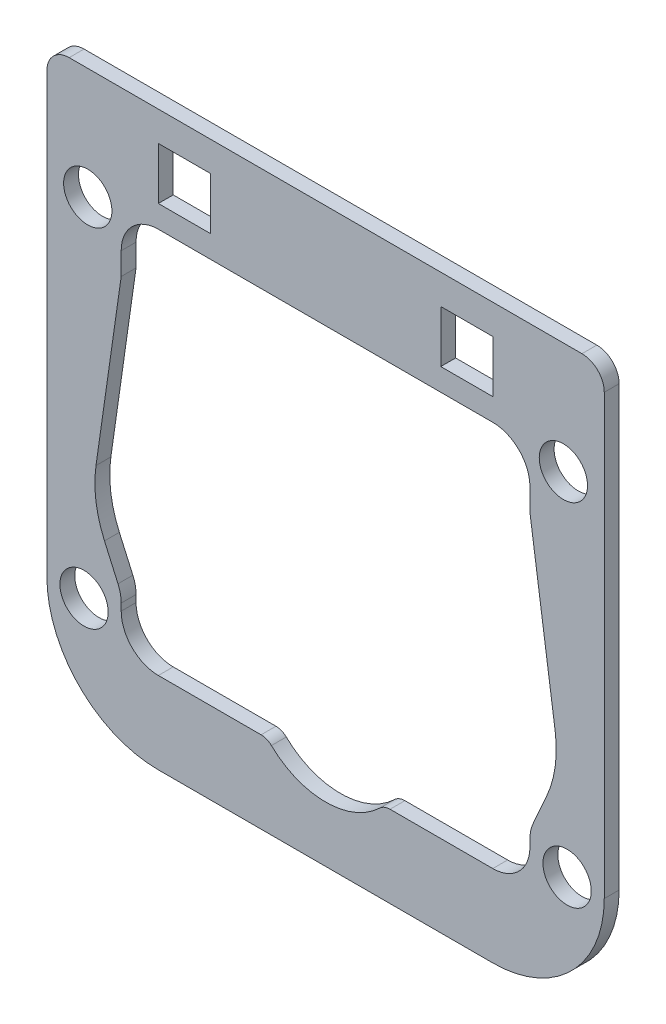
ISO-10303-21;
HEADER;
FILE_DESCRIPTION(('STEP AP214'),'2;1');
FILE_NAME('part.step','',(''),(''),'','','');
FILE_SCHEMA(('AUTOMOTIVE_DESIGN { 1 0 10303 214 1 1 1 1 }'));
ENDSEC;
DATA;
#1=APPLICATION_CONTEXT('core data for automotive mechanical design processes');
#2=APPLICATION_PROTOCOL_DEFINITION('international standard','automotive_design',2000,#1);
#3=PRODUCT_CONTEXT('',#1,'mechanical');
#4=PRODUCT('Part','Part','',(#3));
#5=PRODUCT_RELATED_PRODUCT_CATEGORY('part','',(#4));
#6=PRODUCT_DEFINITION_FORMATION('','',#4);
#7=PRODUCT_DEFINITION_CONTEXT('part definition',#1,'design');
#8=PRODUCT_DEFINITION('design','',#6,#7);
#9=PRODUCT_DEFINITION_SHAPE('','',#8);
#10=(LENGTH_UNIT() NAMED_UNIT(*) SI_UNIT(.MILLI.,.METRE.));
#11=(NAMED_UNIT(*) PLANE_ANGLE_UNIT() SI_UNIT($,.RADIAN.));
#12=(NAMED_UNIT(*) SI_UNIT($,.STERADIAN.) SOLID_ANGLE_UNIT());
#13=UNCERTAINTY_MEASURE_WITH_UNIT(LENGTH_MEASURE(1.E-05),#10,'distance_accuracy_value','');
#14=(GEOMETRIC_REPRESENTATION_CONTEXT(3) GLOBAL_UNCERTAINTY_ASSIGNED_CONTEXT((#13)) GLOBAL_UNIT_ASSIGNED_CONTEXT((#10,
#11,#12)) REPRESENTATION_CONTEXT('',''));
#15=CARTESIAN_POINT('',(0.,0.,0.));
#16=DIRECTION('',(0.,0.,1.));
#17=DIRECTION('',(1.,0.,0.));
#18=AXIS2_PLACEMENT_3D('',#15,#16,#17);
#19=CARTESIAN_POINT('',(15.,-62.,2.));
#20=DIRECTION('',(0.,0.,1.));
#21=DIRECTION('',(1.,0.,0.));
#22=AXIS2_PLACEMENT_3D('',#19,#20,#21);
#23=PLANE('',#22);
#24=DIRECTION('',(-1.,0.,0.));
#25=VECTOR('',#24,1.);
#26=CARTESIAN_POINT('',(22.,-11.,2.));
#27=LINE('',#26,#25);
#28=CARTESIAN_POINT('',(22.,-11.,2.));
#29=VERTEX_POINT('',#28);
#30=CARTESIAN_POINT('',(15.,-11.,2.));
#31=VERTEX_POINT('',#30);
#32=EDGE_CURVE('E323',#29,#31,#27,.T.);
#33=ORIENTED_EDGE('',*,*,#32,.T.);
#34=DIRECTION('',(0.,-1.,0.));
#35=VECTOR('',#34,1.);
#36=CARTESIAN_POINT('',(15.,-4.,2.));
#37=LINE('',#36,#35);
#38=CARTESIAN_POINT('',(15.,-4.,2.));
#39=VERTEX_POINT('',#38);
#40=EDGE_CURVE('E320',#39,#31,#37,.T.);
#41=ORIENTED_EDGE('',*,*,#40,.F.);
#42=DIRECTION('',(1.,0.,0.));
#43=VECTOR('',#42,1.);
#44=CARTESIAN_POINT('',(15.,-4.,2.));
#45=LINE('',#44,#43);
#46=CARTESIAN_POINT('',(22.,-4.,2.));
#47=VERTEX_POINT('',#46);
#48=EDGE_CURVE('E328',#39,#47,#45,.T.);
#49=ORIENTED_EDGE('',*,*,#48,.T.);
#50=DIRECTION('',(0.,1.,0.));
#51=VECTOR('',#50,1.);
#52=CARTESIAN_POINT('',(22.,-11.,2.));
#53=LINE('',#52,#51);
#54=EDGE_CURVE('E326',#29,#47,#53,.T.);
#55=ORIENTED_EDGE('',*,*,#54,.F.);
#56=EDGE_LOOP('',(#33,#41,#49,#55));
#57=FACE_BOUND('',#56,.T.);
#58=CARTESIAN_POINT('',(69.4999999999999,-15.,2.));
#59=DIRECTION('',(0.,0.,-1.));
#60=DIRECTION('',(-1.,0.,0.));
#61=AXIS2_PLACEMENT_3D('',#58,#59,#60);
#62=CIRCLE('',#61,3.25000000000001);
#63=CARTESIAN_POINT('',(66.2499999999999,-15.,2.));
#64=VERTEX_POINT('',#63);
#65=EDGE_CURVE('E343',#64,#64,#62,.T.);
#66=ORIENTED_EDGE('',*,*,#65,.T.);
#67=EDGE_LOOP('',(#66));
#68=FACE_BOUND('',#67,.T.);
#69=CARTESIAN_POINT('',(70.,-62.,2.));
#70=DIRECTION('',(0.,0.,-1.));
#71=DIRECTION('',(-1.,0.,0.));
#72=AXIS2_PLACEMENT_3D('',#69,#70,#71);
#73=CIRCLE('',#72,3.25000000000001);
#74=CARTESIAN_POINT('',(66.75,-62.,2.));
#75=VERTEX_POINT('',#74);
#76=EDGE_CURVE('E349',#75,#75,#73,.T.);
#77=ORIENTED_EDGE('',*,*,#76,.T.);
#78=EDGE_LOOP('',(#77));
#79=FACE_BOUND('',#78,.T.);
#80=CARTESIAN_POINT('',(4.99999999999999,-62.,2.));
#81=DIRECTION('',(0.,0.,1.));
#82=DIRECTION('',(1.,0.,0.));
#83=AXIS2_PLACEMENT_3D('',#80,#81,#82);
#84=CIRCLE('',#83,3.25);
#85=CARTESIAN_POINT('',(8.24999999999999,-62.,2.));
#86=VERTEX_POINT('',#85);
#87=EDGE_CURVE('E361',#86,#86,#84,.T.);
#88=ORIENTED_EDGE('',*,*,#87,.F.);
#89=EDGE_LOOP('',(#88));
#90=FACE_BOUND('',#89,.T.);
#91=DIRECTION('',(1.,0.,0.));
#92=VECTOR('',#91,1.);
#93=CARTESIAN_POINT('',(0.,0.,2.));
#94=LINE('',#93,#92);
#95=CARTESIAN_POINT('',(3.,0.,2.));
#96=VERTEX_POINT('',#95);
#97=CARTESIAN_POINT('',(72.,0.,2.));
#98=VERTEX_POINT('',#97);
#99=EDGE_CURVE('E467',#96,#98,#94,.T.);
#100=ORIENTED_EDGE('',*,*,#99,.F.);
#101=CARTESIAN_POINT('',(3.,-3.,2.));
#102=DIRECTION('',(0.,0.,1.));
#103=DIRECTION('',(1.,0.,0.));
#104=AXIS2_PLACEMENT_3D('',#101,#102,#103);
#105=CIRCLE('',#104,3.);
#106=CARTESIAN_POINT('',(0.,-3.,2.));
#107=VERTEX_POINT('',#106);
#108=EDGE_CURVE('E11',#96,#107,#105,.T.);
#109=ORIENTED_EDGE('',*,*,#108,.T.);
#110=DIRECTION('',(0.,-1.,0.));
#111=VECTOR('',#110,1.);
#112=CARTESIAN_POINT('',(0.,0.,2.));
#113=LINE('',#112,#111);
#114=CARTESIAN_POINT('',(0.,-62.,2.));
#115=VERTEX_POINT('',#114);
#116=EDGE_CURVE('E453',#107,#115,#113,.T.);
#117=ORIENTED_EDGE('',*,*,#116,.T.);
#118=CARTESIAN_POINT('',(15.,-62.,2.));
#119=DIRECTION('',(0.,0.,1.));
#120=DIRECTION('',(1.,0.,0.));
#121=AXIS2_PLACEMENT_3D('',#118,#119,#120);
#122=CIRCLE('',#121,15.);
#123=CARTESIAN_POINT('',(15.,-77.,2.));
#124=VERTEX_POINT('',#123);
#125=EDGE_CURVE('E455',#115,#124,#122,.T.);
#126=ORIENTED_EDGE('',*,*,#125,.T.);
#127=DIRECTION('',(-1.,0.,0.));
#128=VECTOR('',#127,1.);
#129=CARTESIAN_POINT('',(60.,-77.,2.));
#130=LINE('',#129,#128);
#131=CARTESIAN_POINT('',(60.,-77.,2.));
#132=VERTEX_POINT('',#131);
#133=EDGE_CURVE('E458',#132,#124,#130,.T.);
#134=ORIENTED_EDGE('',*,*,#133,.F.);
#135=CARTESIAN_POINT('',(60.,-62.,2.));
#136=DIRECTION('',(0.,0.,1.));
#137=DIRECTION('',(1.,0.,0.));
#138=AXIS2_PLACEMENT_3D('',#135,#136,#137);
#139=CIRCLE('',#138,15.);
#140=CARTESIAN_POINT('',(75.,-62.0000000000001,2.));
#141=VERTEX_POINT('',#140);
#142=EDGE_CURVE('E461',#132,#141,#139,.T.);
#143=ORIENTED_EDGE('',*,*,#142,.T.);
#144=DIRECTION('',(0.,1.,0.));
#145=VECTOR('',#144,1.);
#146=CARTESIAN_POINT('',(75.,-62.0000000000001,2.));
#147=LINE('',#146,#145);
#148=CARTESIAN_POINT('',(75.,-3.,2.));
#149=VERTEX_POINT('',#148);
#150=EDGE_CURVE('E464',#141,#149,#147,.T.);
#151=ORIENTED_EDGE('',*,*,#150,.T.);
#152=CARTESIAN_POINT('',(72.,-3.,2.));
#153=DIRECTION('',(0.,0.,1.));
#154=DIRECTION('',(1.,0.,0.));
#155=AXIS2_PLACEMENT_3D('',#152,#153,#154);
#156=CIRCLE('',#155,3.);
#157=EDGE_CURVE('E577',#149,#98,#156,.T.);
#158=ORIENTED_EDGE('',*,*,#157,.T.);
#159=EDGE_LOOP('',(#100,#109,#117,#126,#134,#143,#151,#158));
#160=FACE_BOUND('',#159,.T.);
#161=DIRECTION('',(-1.,0.,0.));
#162=VECTOR('',#161,1.);
#163=CARTESIAN_POINT('',(65.,-66.,2.));
#164=LINE('',#163,#162);
#165=CARTESIAN_POINT('',(60.,-66.,2.));
#166=VERTEX_POINT('',#165);
#167=CARTESIAN_POINT('',(46.1746757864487,-66.,2.));
#168=VERTEX_POINT('',#167);
#169=EDGE_CURVE('E414',#166,#168,#164,.T.);
#170=ORIENTED_EDGE('',*,*,#169,.T.);
#171=CARTESIAN_POINT('',(46.1746757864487,-68.,2.));
#172=DIRECTION('',(0.,0.,1.));
#173=DIRECTION('',(1.,0.,0.));
#174=AXIS2_PLACEMENT_3D('',#171,#172,#173);
#175=CIRCLE('',#174,2.);
#176=CARTESIAN_POINT('',(44.7867276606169,-66.56,2.));
#177=VERTEX_POINT('',#176);
#178=EDGE_CURVE('E547',#168,#177,#175,.T.);
#179=ORIENTED_EDGE('',*,*,#178,.T.);
#180=CARTESIAN_POINT('',(37.5,-59.,2.));
#181=DIRECTION('',(0.,0.,1.));
#182=DIRECTION('',(1.,0.,0.));
#183=AXIS2_PLACEMENT_3D('',#180,#181,#182);
#184=CIRCLE('',#183,10.5);
#185=CARTESIAN_POINT('',(30.2132723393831,-66.56,2.));
#186=VERTEX_POINT('',#185);
#187=EDGE_CURVE('E411',#186,#177,#184,.T.);
#188=ORIENTED_EDGE('',*,*,#187,.F.);
#189=CARTESIAN_POINT('',(28.8253242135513,-68.,2.));
#190=DIRECTION('',(0.,0.,1.));
#191=DIRECTION('',(1.,0.,0.));
#192=AXIS2_PLACEMENT_3D('',#189,#190,#191);
#193=CIRCLE('',#192,2.);
#194=CARTESIAN_POINT('',(28.8253242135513,-66.,2.));
#195=VERTEX_POINT('',#194);
#196=EDGE_CURVE('E545',#186,#195,#193,.T.);
#197=ORIENTED_EDGE('',*,*,#196,.T.);
#198=DIRECTION('',(-1.,0.,0.));
#199=VECTOR('',#198,1.);
#200=CARTESIAN_POINT('',(29.6737620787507,-66.,2.));
#201=LINE('',#200,#199);
#202=CARTESIAN_POINT('',(15.,-66.,2.));
#203=VERTEX_POINT('',#202);
#204=EDGE_CURVE('E409',#195,#203,#201,.T.);
#205=ORIENTED_EDGE('',*,*,#204,.T.);
#206=CARTESIAN_POINT('',(15.,-61.,2.));
#207=DIRECTION('',(0.,0.,1.));
#208=DIRECTION('',(1.,0.,0.));
#209=AXIS2_PLACEMENT_3D('',#206,#207,#208);
#210=CIRCLE('',#209,5.);
#211=CARTESIAN_POINT('',(9.99999999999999,-61.,2.));
#212=VERTEX_POINT('',#211);
#213=EDGE_CURVE('E505',#203,#212,#210,.F.);
#214=ORIENTED_EDGE('',*,*,#213,.T.);
#215=DIRECTION('',(0.,-1.,0.));
#216=VECTOR('',#215,1.);
#217=CARTESIAN_POINT('',(9.99999999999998,-59.,2.));
#218=LINE('',#217,#216);
#219=CARTESIAN_POINT('',(9.99999999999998,-60.0610722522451,2.));
#220=VERTEX_POINT('',#219);
#221=EDGE_CURVE('E406',#220,#212,#218,.T.);
#222=ORIENTED_EDGE('',*,*,#221,.F.);
#223=CARTESIAN_POINT('',(4.99999999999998,-60.0610722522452,2.));
#224=DIRECTION('',(0.,0.,1.));
#225=DIRECTION('',(1.,0.,0.));
#226=AXIS2_PLACEMENT_3D('',#223,#224,#225);
#227=CIRCLE('',#226,5.);
#228=CARTESIAN_POINT('',(9.56905774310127,-58.0303799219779,2.));
#229=VERTEX_POINT('',#228);
#230=EDGE_CURVE('E494',#220,#229,#227,.T.);
#231=ORIENTED_EDGE('',*,*,#230,.T.);
#232=DIRECTION('',(0.406138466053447,-0.913811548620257,0.));
#233=VECTOR('',#232,1.);
#234=CARTESIAN_POINT('',(5.99999999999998,-50.,2.));
#235=LINE('',#234,#233);
#236=CARTESIAN_POINT('',(7.75220341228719,-53.9424576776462,2.));
#237=VERTEX_POINT('',#236);
#238=EDGE_CURVE('E403',#237,#229,#235,.T.);
#239=ORIENTED_EDGE('',*,*,#238,.F.);
#240=CARTESIAN_POINT('',(21.4593766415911,-47.8503806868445,2.));
#241=DIRECTION('',(0.,0.,1.));
#242=DIRECTION('',(1.,0.,0.));
#243=AXIS2_PLACEMENT_3D('',#240,#241,#242);
#244=CIRCLE('',#243,15.);
#245=CARTESIAN_POINT('',(6.61013423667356,-45.7290603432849,2.));
#246=VERTEX_POINT('',#245);
#247=EDGE_CURVE('E485',#237,#246,#244,.F.);
#248=ORIENTED_EDGE('',*,*,#247,.T.);
#249=DIRECTION('',(-0.141421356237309,-0.989949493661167,0.));
#250=VECTOR('',#249,1.);
#251=CARTESIAN_POINT('',(9.99999999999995,-22.,2.));
#252=LINE('',#251,#250);
#253=CARTESIAN_POINT('',(9.99999999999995,-22.,2.));
#254=VERTEX_POINT('',#253);
#255=EDGE_CURVE('E400',#254,#246,#252,.T.);
#256=ORIENTED_EDGE('',*,*,#255,.F.);
#257=DIRECTION('',(0.,-1.,0.));
#258=VECTOR('',#257,1.);
#259=CARTESIAN_POINT('',(10.,-14.,2.));
#260=LINE('',#259,#258);
#261=CARTESIAN_POINT('',(9.99999999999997,-19.,2.));
#262=VERTEX_POINT('',#261);
#263=EDGE_CURVE('E398',#262,#254,#260,.T.);
#264=ORIENTED_EDGE('',*,*,#263,.F.);
#265=CARTESIAN_POINT('',(15.,-19.,2.));
#266=DIRECTION('',(0.,0.,1.));
#267=DIRECTION('',(1.,0.,0.));
#268=AXIS2_PLACEMENT_3D('',#265,#266,#267);
#269=CIRCLE('',#268,5.);
#270=CARTESIAN_POINT('',(15.,-14.,2.));
#271=VERTEX_POINT('',#270);
#272=EDGE_CURVE('E559',#262,#271,#269,.F.);
#273=ORIENTED_EDGE('',*,*,#272,.T.);
#274=DIRECTION('',(1.,0.,0.));
#275=VECTOR('',#274,1.);
#276=CARTESIAN_POINT('',(10.,-14.,2.));
#277=LINE('',#276,#275);
#278=CARTESIAN_POINT('',(60.,-14.,2.));
#279=VERTEX_POINT('',#278);
#280=EDGE_CURVE('E429',#271,#279,#277,.T.);
#281=ORIENTED_EDGE('',*,*,#280,.T.);
#282=CARTESIAN_POINT('',(60.,-19.,2.));
#283=DIRECTION('',(0.,0.,1.));
#284=DIRECTION('',(1.,0.,0.));
#285=AXIS2_PLACEMENT_3D('',#282,#283,#284);
#286=CIRCLE('',#285,5.);
#287=CARTESIAN_POINT('',(65.,-19.,2.));
#288=VERTEX_POINT('',#287);
#289=EDGE_CURVE('E568',#279,#288,#286,.F.);
#290=ORIENTED_EDGE('',*,*,#289,.T.);
#291=DIRECTION('',(0.,1.,0.));
#292=VECTOR('',#291,1.);
#293=CARTESIAN_POINT('',(65.,-22.,2.));
#294=LINE('',#293,#292);
#295=CARTESIAN_POINT('',(65.,-22.,2.));
#296=VERTEX_POINT('',#295);
#297=EDGE_CURVE('E426',#296,#288,#294,.T.);
#298=ORIENTED_EDGE('',*,*,#297,.F.);
#299=DIRECTION('',(0.141421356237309,-0.989949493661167,0.));
#300=VECTOR('',#299,1.);
#301=CARTESIAN_POINT('',(65.,-22.,2.));
#302=LINE('',#301,#300);
#303=CARTESIAN_POINT('',(68.3898657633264,-45.7290603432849,2.));
#304=VERTEX_POINT('',#303);
#305=EDGE_CURVE('E423',#296,#304,#302,.T.);
#306=ORIENTED_EDGE('',*,*,#305,.T.);
#307=CARTESIAN_POINT('',(53.5406233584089,-47.8503806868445,2.));
#308=DIRECTION('',(0.,0.,1.));
#309=DIRECTION('',(1.,0.,0.));
#310=AXIS2_PLACEMENT_3D('',#307,#308,#309);
#311=CIRCLE('',#310,15.);
#312=CARTESIAN_POINT('',(67.2477965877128,-53.9424576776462,2.));
#313=VERTEX_POINT('',#312);
#314=EDGE_CURVE('E514',#304,#313,#311,.F.);
#315=ORIENTED_EDGE('',*,*,#314,.T.);
#316=DIRECTION('',(-0.406138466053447,-0.913811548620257,0.));
#317=VECTOR('',#316,1.);
#318=CARTESIAN_POINT('',(69.,-50.,2.));
#319=LINE('',#318,#317);
#320=CARTESIAN_POINT('',(65.4309422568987,-58.0303799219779,2.));
#321=VERTEX_POINT('',#320);
#322=EDGE_CURVE('E420',#313,#321,#319,.T.);
#323=ORIENTED_EDGE('',*,*,#322,.T.);
#324=CARTESIAN_POINT('',(70.,-60.0610722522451,2.));
#325=DIRECTION('',(0.,0.,1.));
#326=DIRECTION('',(1.,0.,0.));
#327=AXIS2_PLACEMENT_3D('',#324,#325,#326);
#328=CIRCLE('',#327,5.);
#329=CARTESIAN_POINT('',(65.,-60.0610722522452,2.));
#330=VERTEX_POINT('',#329);
#331=EDGE_CURVE('E525',#321,#330,#328,.T.);
#332=ORIENTED_EDGE('',*,*,#331,.T.);
#333=DIRECTION('',(0.,1.,0.));
#334=VECTOR('',#333,1.);
#335=CARTESIAN_POINT('',(65.,-66.,2.));
#336=LINE('',#335,#334);
#337=CARTESIAN_POINT('',(65.,-61.,2.));
#338=VERTEX_POINT('',#337);
#339=EDGE_CURVE('E417',#338,#330,#336,.T.);
#340=ORIENTED_EDGE('',*,*,#339,.F.);
#341=CARTESIAN_POINT('',(60.,-61.,2.));
#342=DIRECTION('',(0.,0.,1.));
#343=DIRECTION('',(1.,0.,0.));
#344=AXIS2_PLACEMENT_3D('',#341,#342,#343);
#345=CIRCLE('',#344,5.);
#346=EDGE_CURVE('E532',#338,#166,#345,.F.);
#347=ORIENTED_EDGE('',*,*,#346,.T.);
#348=EDGE_LOOP('',(#170,#179,#188,#197,#205,#214,#222,#231,#239,#248,#256,#264,#273,#281,#290,
#298,#306,#315,#323,#332,#340,#347));
#349=FACE_BOUND('',#348,.T.);
#350=CARTESIAN_POINT('',(5.5,-15.,2.));
#351=DIRECTION('',(0.,0.,1.));
#352=DIRECTION('',(1.,0.,0.));
#353=AXIS2_PLACEMENT_3D('',#350,#351,#352);
#354=CIRCLE('',#353,3.25);
#355=CARTESIAN_POINT('',(8.75,-15.,2.));
#356=VERTEX_POINT('',#355);
#357=EDGE_CURVE('E355',#356,#356,#354,.T.);
#358=ORIENTED_EDGE('',*,*,#357,.F.);
#359=EDGE_LOOP('',(#358));
#360=FACE_BOUND('',#359,.T.);
#361=DIRECTION('',(0.,-1.,0.));
#362=VECTOR('',#361,1.);
#363=CARTESIAN_POINT('',(60.,-4.,2.));
#364=LINE('',#363,#362);
#365=CARTESIAN_POINT('',(60.,-4.,2.));
#366=VERTEX_POINT('',#365);
#367=CARTESIAN_POINT('',(60.,-11.,2.));
#368=VERTEX_POINT('',#367);
#369=EDGE_CURVE('E297',#366,#368,#364,.T.);
#370=ORIENTED_EDGE('',*,*,#369,.T.);
#371=DIRECTION('',(1.,0.,0.));
#372=VECTOR('',#371,1.);
#373=CARTESIAN_POINT('',(53.,-11.,2.));
#374=LINE('',#373,#372);
#375=CARTESIAN_POINT('',(53.,-11.,2.));
#376=VERTEX_POINT('',#375);
#377=EDGE_CURVE('E273',#376,#368,#374,.T.);
#378=ORIENTED_EDGE('',*,*,#377,.F.);
#379=DIRECTION('',(0.,1.,0.));
#380=VECTOR('',#379,1.);
#381=CARTESIAN_POINT('',(53.,-11.,2.));
#382=LINE('',#381,#380);
#383=CARTESIAN_POINT('',(53.,-4.,2.));
#384=VERTEX_POINT('',#383);
#385=EDGE_CURVE('E301',#376,#384,#382,.T.);
#386=ORIENTED_EDGE('',*,*,#385,.T.);
#387=DIRECTION('',(-1.,0.,0.));
#388=VECTOR('',#387,1.);
#389=CARTESIAN_POINT('',(60.,-4.,2.));
#390=LINE('',#389,#388);
#391=EDGE_CURVE('E299',#366,#384,#390,.T.);
#392=ORIENTED_EDGE('',*,*,#391,.F.);
#393=EDGE_LOOP('',(#370,#378,#386,#392));
#394=FACE_BOUND('',#393,.T.);
#395=ADVANCED_FACE('F24',(#57,#68,#79,#90,#160,#349,#360,#394),#23,.T.);
#396=CARTESIAN_POINT('',(15.,-62.,0.));
#397=DIRECTION('',(0.,0.,1.));
#398=DIRECTION('',(1.,0.,0.));
#399=AXIS2_PLACEMENT_3D('',#396,#397,#398);
#400=PLANE('',#399);
#401=DIRECTION('',(0.,-1.,0.));
#402=VECTOR('',#401,1.);
#403=CARTESIAN_POINT('',(15.,-4.,0.));
#404=LINE('',#403,#402);
#405=CARTESIAN_POINT('',(15.,-4.,0.));
#406=VERTEX_POINT('',#405);
#407=CARTESIAN_POINT('',(15.,-11.,0.));
#408=VERTEX_POINT('',#407);
#409=EDGE_CURVE('E277',#406,#408,#404,.T.);
#410=ORIENTED_EDGE('',*,*,#409,.T.);
#411=DIRECTION('',(-1.,0.,0.));
#412=VECTOR('',#411,1.);
#413=CARTESIAN_POINT('',(22.,-11.,0.));
#414=LINE('',#413,#412);
#415=CARTESIAN_POINT('',(22.,-11.,0.));
#416=VERTEX_POINT('',#415);
#417=EDGE_CURVE('E311',#416,#408,#414,.T.);
#418=ORIENTED_EDGE('',*,*,#417,.F.);
#419=DIRECTION('',(0.,1.,0.));
#420=VECTOR('',#419,1.);
#421=CARTESIAN_POINT('',(22.,-11.,0.));
#422=LINE('',#421,#420);
#423=CARTESIAN_POINT('',(22.,-4.,0.));
#424=VERTEX_POINT('',#423);
#425=EDGE_CURVE('E314',#416,#424,#422,.T.);
#426=ORIENTED_EDGE('',*,*,#425,.T.);
#427=DIRECTION('',(1.,0.,0.));
#428=VECTOR('',#427,1.);
#429=CARTESIAN_POINT('',(15.,-4.,0.));
#430=LINE('',#429,#428);
#431=EDGE_CURVE('E317',#406,#424,#430,.T.);
#432=ORIENTED_EDGE('',*,*,#431,.F.);
#433=EDGE_LOOP('',(#410,#418,#426,#432));
#434=FACE_BOUND('',#433,.T.);
#435=CARTESIAN_POINT('',(69.4999999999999,-15.,0.));
#436=DIRECTION('',(0.,0.,-1.));
#437=DIRECTION('',(-1.,0.,0.));
#438=AXIS2_PLACEMENT_3D('',#435,#436,#437);
#439=CIRCLE('',#438,3.25000000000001);
#440=CARTESIAN_POINT('',(66.2499999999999,-15.,0.));
#441=VERTEX_POINT('',#440);
#442=EDGE_CURVE('E340',#441,#441,#439,.T.);
#443=ORIENTED_EDGE('',*,*,#442,.F.);
#444=EDGE_LOOP('',(#443));
#445=FACE_BOUND('',#444,.T.);
#446=CARTESIAN_POINT('',(70.,-62.,0.));
#447=DIRECTION('',(0.,0.,-1.));
#448=DIRECTION('',(-1.,0.,0.));
#449=AXIS2_PLACEMENT_3D('',#446,#447,#448);
#450=CIRCLE('',#449,3.25000000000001);
#451=CARTESIAN_POINT('',(66.75,-62.,0.));
#452=VERTEX_POINT('',#451);
#453=EDGE_CURVE('E346',#452,#452,#450,.T.);
#454=ORIENTED_EDGE('',*,*,#453,.F.);
#455=EDGE_LOOP('',(#454));
#456=FACE_BOUND('',#455,.T.);
#457=CARTESIAN_POINT('',(4.99999999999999,-62.,0.));
#458=DIRECTION('',(0.,0.,1.));
#459=DIRECTION('',(1.,0.,0.));
#460=AXIS2_PLACEMENT_3D('',#457,#458,#459);
#461=CIRCLE('',#460,3.25);
#462=CARTESIAN_POINT('',(8.24999999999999,-62.,0.));
#463=VERTEX_POINT('',#462);
#464=EDGE_CURVE('E358',#463,#463,#461,.T.);
#465=ORIENTED_EDGE('',*,*,#464,.T.);
#466=EDGE_LOOP('',(#465));
#467=FACE_BOUND('',#466,.T.);
#468=DIRECTION('',(0.,-1.,0.));
#469=VECTOR('',#468,1.);
#470=CARTESIAN_POINT('',(0.,0.,0.));
#471=LINE('',#470,#469);
#472=CARTESIAN_POINT('',(0.,-3.,0.));
#473=VERTEX_POINT('',#472);
#474=CARTESIAN_POINT('',(0.,-62.,0.));
#475=VERTEX_POINT('',#474);
#476=EDGE_CURVE('E437',#473,#475,#471,.T.);
#477=ORIENTED_EDGE('',*,*,#476,.F.);
#478=CARTESIAN_POINT('',(3.,-3.,0.));
#479=DIRECTION('',(0.,0.,1.));
#480=DIRECTION('',(1.,0.,0.));
#481=AXIS2_PLACEMENT_3D('',#478,#479,#480);
#482=CIRCLE('',#481,3.);
#483=CARTESIAN_POINT('',(3.,0.,0.));
#484=VERTEX_POINT('',#483);
#485=EDGE_CURVE('E46',#473,#484,#482,.F.);
#486=ORIENTED_EDGE('',*,*,#485,.T.);
#487=DIRECTION('',(1.,0.,0.));
#488=VECTOR('',#487,1.);
#489=CARTESIAN_POINT('',(0.,0.,0.));
#490=LINE('',#489,#488);
#491=CARTESIAN_POINT('',(72.,0.,0.));
#492=VERTEX_POINT('',#491);
#493=EDGE_CURVE('E451',#484,#492,#490,.T.);
#494=ORIENTED_EDGE('',*,*,#493,.T.);
#495=CARTESIAN_POINT('',(72.,-3.,0.));
#496=DIRECTION('',(0.,0.,1.));
#497=DIRECTION('',(1.,0.,0.));
#498=AXIS2_PLACEMENT_3D('',#495,#496,#497);
#499=CIRCLE('',#498,3.);
#500=CARTESIAN_POINT('',(75.,-3.,0.));
#501=VERTEX_POINT('',#500);
#502=EDGE_CURVE('E573',#492,#501,#499,.F.);
#503=ORIENTED_EDGE('',*,*,#502,.T.);
#504=DIRECTION('',(0.,1.,0.));
#505=VECTOR('',#504,1.);
#506=CARTESIAN_POINT('',(75.,-62.0000000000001,0.));
#507=LINE('',#506,#505);
#508=CARTESIAN_POINT('',(75.,-62.0000000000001,0.));
#509=VERTEX_POINT('',#508);
#510=EDGE_CURVE('E448',#509,#501,#507,.T.);
#511=ORIENTED_EDGE('',*,*,#510,.F.);
#512=CARTESIAN_POINT('',(60.,-62.,0.));
#513=DIRECTION('',(0.,0.,1.));
#514=DIRECTION('',(1.,0.,0.));
#515=AXIS2_PLACEMENT_3D('',#512,#513,#514);
#516=CIRCLE('',#515,15.);
#517=CARTESIAN_POINT('',(60.,-77.,0.));
#518=VERTEX_POINT('',#517);
#519=EDGE_CURVE('E445',#518,#509,#516,.T.);
#520=ORIENTED_EDGE('',*,*,#519,.F.);
#521=DIRECTION('',(-1.,0.,0.));
#522=VECTOR('',#521,1.);
#523=CARTESIAN_POINT('',(60.,-77.,0.));
#524=LINE('',#523,#522);
#525=CARTESIAN_POINT('',(15.,-77.,0.));
#526=VERTEX_POINT('',#525);
#527=EDGE_CURVE('E442',#518,#526,#524,.T.);
#528=ORIENTED_EDGE('',*,*,#527,.T.);
#529=CARTESIAN_POINT('',(15.,-62.,0.));
#530=DIRECTION('',(0.,0.,1.));
#531=DIRECTION('',(1.,0.,0.));
#532=AXIS2_PLACEMENT_3D('',#529,#530,#531);
#533=CIRCLE('',#532,15.);
#534=EDGE_CURVE('E439',#475,#526,#533,.T.);
#535=ORIENTED_EDGE('',*,*,#534,.F.);
#536=EDGE_LOOP('',(#477,#486,#494,#503,#511,#520,#528,#535));
#537=FACE_BOUND('',#536,.T.);
#538=CARTESIAN_POINT('',(37.5,-59.,0.));
#539=DIRECTION('',(0.,0.,1.));
#540=DIRECTION('',(1.,0.,0.));
#541=AXIS2_PLACEMENT_3D('',#538,#539,#540);
#542=CIRCLE('',#541,10.5);
#543=CARTESIAN_POINT('',(30.2132723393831,-66.56,0.));
#544=VERTEX_POINT('',#543);
#545=CARTESIAN_POINT('',(44.7867276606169,-66.56,0.));
#546=VERTEX_POINT('',#545);
#547=EDGE_CURVE('E377',#544,#546,#542,.T.);
#548=ORIENTED_EDGE('',*,*,#547,.T.);
#549=CARTESIAN_POINT('',(46.1746757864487,-68.,0.));
#550=DIRECTION('',(0.,0.,1.));
#551=DIRECTION('',(1.,0.,0.));
#552=AXIS2_PLACEMENT_3D('',#549,#550,#551);
#553=CIRCLE('',#552,2.);
#554=CARTESIAN_POINT('',(46.1746757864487,-66.,0.));
#555=VERTEX_POINT('',#554);
#556=EDGE_CURVE('E541',#546,#555,#553,.F.);
#557=ORIENTED_EDGE('',*,*,#556,.T.);
#558=DIRECTION('',(-1.,0.,0.));
#559=VECTOR('',#558,1.);
#560=CARTESIAN_POINT('',(65.,-66.,0.));
#561=LINE('',#560,#559);
#562=CARTESIAN_POINT('',(60.,-66.,0.));
#563=VERTEX_POINT('',#562);
#564=EDGE_CURVE('E380',#563,#555,#561,.T.);
#565=ORIENTED_EDGE('',*,*,#564,.F.);
#566=CARTESIAN_POINT('',(60.,-61.,0.));
#567=DIRECTION('',(0.,0.,1.));
#568=DIRECTION('',(1.,0.,0.));
#569=AXIS2_PLACEMENT_3D('',#566,#567,#568);
#570=CIRCLE('',#569,5.);
#571=CARTESIAN_POINT('',(65.,-61.,0.));
#572=VERTEX_POINT('',#571);
#573=EDGE_CURVE('E530',#563,#572,#570,.T.);
#574=ORIENTED_EDGE('',*,*,#573,.T.);
#575=DIRECTION('',(0.,1.,0.));
#576=VECTOR('',#575,1.);
#577=CARTESIAN_POINT('',(65.,-66.,0.));
#578=LINE('',#577,#576);
#579=CARTESIAN_POINT('',(65.,-60.0610722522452,0.));
#580=VERTEX_POINT('',#579);
#581=EDGE_CURVE('E383',#572,#580,#578,.T.);
#582=ORIENTED_EDGE('',*,*,#581,.T.);
#583=CARTESIAN_POINT('',(70.,-60.0610722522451,0.));
#584=DIRECTION('',(0.,0.,1.));
#585=DIRECTION('',(1.,0.,0.));
#586=AXIS2_PLACEMENT_3D('',#583,#584,#585);
#587=CIRCLE('',#586,5.);
#588=CARTESIAN_POINT('',(65.4309422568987,-58.0303799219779,0.));
#589=VERTEX_POINT('',#588);
#590=EDGE_CURVE('E521',#580,#589,#587,.F.);
#591=ORIENTED_EDGE('',*,*,#590,.T.);
#592=DIRECTION('',(-0.406138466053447,-0.913811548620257,0.));
#593=VECTOR('',#592,1.);
#594=CARTESIAN_POINT('',(69.,-50.,0.));
#595=LINE('',#594,#593);
#596=CARTESIAN_POINT('',(67.2477965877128,-53.9424576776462,0.));
#597=VERTEX_POINT('',#596);
#598=EDGE_CURVE('E386',#597,#589,#595,.T.);
#599=ORIENTED_EDGE('',*,*,#598,.F.);
#600=CARTESIAN_POINT('',(53.5406233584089,-47.8503806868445,0.));
#601=DIRECTION('',(0.,0.,1.));
#602=DIRECTION('',(1.,0.,0.));
#603=AXIS2_PLACEMENT_3D('',#600,#601,#602);
#604=CIRCLE('',#603,15.);
#605=CARTESIAN_POINT('',(68.3898657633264,-45.7290603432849,0.));
#606=VERTEX_POINT('',#605);
#607=EDGE_CURVE('E512',#597,#606,#604,.T.);
#608=ORIENTED_EDGE('',*,*,#607,.T.);
#609=DIRECTION('',(0.141421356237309,-0.989949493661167,0.));
#610=VECTOR('',#609,1.);
#611=CARTESIAN_POINT('',(65.,-22.,0.));
#612=LINE('',#611,#610);
#613=CARTESIAN_POINT('',(65.,-22.,0.));
#614=VERTEX_POINT('',#613);
#615=EDGE_CURVE('E389',#614,#606,#612,.T.);
#616=ORIENTED_EDGE('',*,*,#615,.F.);
#617=DIRECTION('',(0.,1.,0.));
#618=VECTOR('',#617,1.);
#619=CARTESIAN_POINT('',(65.,-22.,0.));
#620=LINE('',#619,#618);
#621=CARTESIAN_POINT('',(65.,-19.,0.));
#622=VERTEX_POINT('',#621);
#623=EDGE_CURVE('E392',#614,#622,#620,.T.);
#624=ORIENTED_EDGE('',*,*,#623,.T.);
#625=CARTESIAN_POINT('',(60.,-19.,0.));
#626=DIRECTION('',(0.,0.,1.));
#627=DIRECTION('',(1.,0.,0.));
#628=AXIS2_PLACEMENT_3D('',#625,#626,#627);
#629=CIRCLE('',#628,5.);
#630=CARTESIAN_POINT('',(60.,-14.,0.));
#631=VERTEX_POINT('',#630);
#632=EDGE_CURVE('E566',#622,#631,#629,.T.);
#633=ORIENTED_EDGE('',*,*,#632,.T.);
#634=DIRECTION('',(1.,0.,0.));
#635=VECTOR('',#634,1.);
#636=CARTESIAN_POINT('',(10.,-14.,0.));
#637=LINE('',#636,#635);
#638=CARTESIAN_POINT('',(15.,-14.,0.));
#639=VERTEX_POINT('',#638);
#640=EDGE_CURVE('E395',#639,#631,#637,.T.);
#641=ORIENTED_EDGE('',*,*,#640,.F.);
#642=CARTESIAN_POINT('',(15.,-19.,0.));
#643=DIRECTION('',(0.,0.,1.));
#644=DIRECTION('',(1.,0.,0.));
#645=AXIS2_PLACEMENT_3D('',#642,#643,#644);
#646=CIRCLE('',#645,5.);
#647=CARTESIAN_POINT('',(9.99999999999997,-19.,0.));
#648=VERTEX_POINT('',#647);
#649=EDGE_CURVE('E557',#639,#648,#646,.T.);
#650=ORIENTED_EDGE('',*,*,#649,.T.);
#651=DIRECTION('',(0.,-1.,0.));
#652=VECTOR('',#651,1.);
#653=CARTESIAN_POINT('',(10.,-14.,0.));
#654=LINE('',#653,#652);
#655=CARTESIAN_POINT('',(9.99999999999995,-22.,0.));
#656=VERTEX_POINT('',#655);
#657=EDGE_CURVE('E364',#648,#656,#654,.T.);
#658=ORIENTED_EDGE('',*,*,#657,.T.);
#659=DIRECTION('',(-0.141421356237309,-0.989949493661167,0.));
#660=VECTOR('',#659,1.);
#661=CARTESIAN_POINT('',(9.99999999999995,-22.,0.));
#662=LINE('',#661,#660);
#663=CARTESIAN_POINT('',(6.61013423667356,-45.7290603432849,0.));
#664=VERTEX_POINT('',#663);
#665=EDGE_CURVE('E366',#656,#664,#662,.T.);
#666=ORIENTED_EDGE('',*,*,#665,.T.);
#667=CARTESIAN_POINT('',(21.4593766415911,-47.8503806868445,0.));
#668=DIRECTION('',(0.,0.,1.));
#669=DIRECTION('',(1.,0.,0.));
#670=AXIS2_PLACEMENT_3D('',#667,#668,#669);
#671=CIRCLE('',#670,15.);
#672=CARTESIAN_POINT('',(7.75220341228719,-53.9424576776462,0.));
#673=VERTEX_POINT('',#672);
#674=EDGE_CURVE('E483',#664,#673,#671,.T.);
#675=ORIENTED_EDGE('',*,*,#674,.T.);
#676=DIRECTION('',(0.406138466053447,-0.913811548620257,0.));
#677=VECTOR('',#676,1.);
#678=CARTESIAN_POINT('',(5.99999999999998,-50.,0.));
#679=LINE('',#678,#677);
#680=CARTESIAN_POINT('',(9.56905774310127,-58.0303799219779,0.));
#681=VERTEX_POINT('',#680);
#682=EDGE_CURVE('E369',#673,#681,#679,.T.);
#683=ORIENTED_EDGE('',*,*,#682,.T.);
#684=CARTESIAN_POINT('',(4.99999999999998,-60.0610722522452,0.));
#685=DIRECTION('',(0.,0.,1.));
#686=DIRECTION('',(1.,0.,0.));
#687=AXIS2_PLACEMENT_3D('',#684,#685,#686);
#688=CIRCLE('',#687,5.);
#689=CARTESIAN_POINT('',(9.99999999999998,-60.0610722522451,0.));
#690=VERTEX_POINT('',#689);
#691=EDGE_CURVE('E490',#681,#690,#688,.F.);
#692=ORIENTED_EDGE('',*,*,#691,.T.);
#693=DIRECTION('',(0.,-1.,0.));
#694=VECTOR('',#693,1.);
#695=CARTESIAN_POINT('',(9.99999999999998,-59.,0.));
#696=LINE('',#695,#694);
#697=CARTESIAN_POINT('',(9.99999999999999,-61.,0.));
#698=VERTEX_POINT('',#697);
#699=EDGE_CURVE('E372',#690,#698,#696,.T.);
#700=ORIENTED_EDGE('',*,*,#699,.T.);
#701=CARTESIAN_POINT('',(15.,-61.,0.));
#702=DIRECTION('',(0.,0.,1.));
#703=DIRECTION('',(1.,0.,0.));
#704=AXIS2_PLACEMENT_3D('',#701,#702,#703);
#705=CIRCLE('',#704,5.);
#706=CARTESIAN_POINT('',(15.,-66.,0.));
#707=VERTEX_POINT('',#706);
#708=EDGE_CURVE('E502',#698,#707,#705,.T.);
#709=ORIENTED_EDGE('',*,*,#708,.T.);
#710=DIRECTION('',(-1.,0.,0.));
#711=VECTOR('',#710,1.);
#712=CARTESIAN_POINT('',(29.6737620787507,-66.,0.));
#713=LINE('',#712,#711);
#714=CARTESIAN_POINT('',(28.8253242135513,-66.,0.));
#715=VERTEX_POINT('',#714);
#716=EDGE_CURVE('E375',#715,#707,#713,.T.);
#717=ORIENTED_EDGE('',*,*,#716,.F.);
#718=CARTESIAN_POINT('',(28.8253242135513,-68.,0.));
#719=DIRECTION('',(0.,0.,1.));
#720=DIRECTION('',(1.,0.,0.));
#721=AXIS2_PLACEMENT_3D('',#718,#719,#720);
#722=CIRCLE('',#721,2.);
#723=EDGE_CURVE('E539',#715,#544,#722,.F.);
#724=ORIENTED_EDGE('',*,*,#723,.T.);
#725=EDGE_LOOP('',(#548,#557,#565,#574,#582,#591,#599,#608,#616,#624,#633,#641,#650,#658,#666,
#675,#683,#692,#700,#709,#717,#724));
#726=FACE_BOUND('',#725,.T.);
#727=CARTESIAN_POINT('',(5.5,-15.,0.));
#728=DIRECTION('',(0.,0.,1.));
#729=DIRECTION('',(1.,0.,0.));
#730=AXIS2_PLACEMENT_3D('',#727,#728,#729);
#731=CIRCLE('',#730,3.25);
#732=CARTESIAN_POINT('',(8.75,-15.,0.));
#733=VERTEX_POINT('',#732);
#734=EDGE_CURVE('E352',#733,#733,#731,.T.);
#735=ORIENTED_EDGE('',*,*,#734,.T.);
#736=EDGE_LOOP('',(#735));
#737=FACE_BOUND('',#736,.T.);
#738=DIRECTION('',(1.,0.,0.));
#739=VECTOR('',#738,1.);
#740=CARTESIAN_POINT('',(53.,-11.,0.));
#741=LINE('',#740,#739);
#742=CARTESIAN_POINT('',(53.,-11.,0.));
#743=VERTEX_POINT('',#742);
#744=CARTESIAN_POINT('',(60.,-11.,0.));
#745=VERTEX_POINT('',#744);
#746=EDGE_CURVE('E270',#743,#745,#741,.T.);
#747=ORIENTED_EDGE('',*,*,#746,.T.);
#748=DIRECTION('',(0.,-1.,0.));
#749=VECTOR('',#748,1.);
#750=CARTESIAN_POINT('',(60.,-4.,0.));
#751=LINE('',#750,#749);
#752=CARTESIAN_POINT('',(60.,-4.,0.));
#753=VERTEX_POINT('',#752);
#754=EDGE_CURVE('E281',#753,#745,#751,.T.);
#755=ORIENTED_EDGE('',*,*,#754,.F.);
#756=DIRECTION('',(-1.,0.,0.));
#757=VECTOR('',#756,1.);
#758=CARTESIAN_POINT('',(60.,-4.,0.));
#759=LINE('',#758,#757);
#760=CARTESIAN_POINT('',(53.,-4.,0.));
#761=VERTEX_POINT('',#760);
#762=EDGE_CURVE('E286',#753,#761,#759,.T.);
#763=ORIENTED_EDGE('',*,*,#762,.T.);
#764=DIRECTION('',(0.,1.,0.));
#765=VECTOR('',#764,1.);
#766=CARTESIAN_POINT('',(53.,-11.,0.));
#767=LINE('',#766,#765);
#768=EDGE_CURVE('E291',#743,#761,#767,.T.);
#769=ORIENTED_EDGE('',*,*,#768,.F.);
#770=EDGE_LOOP('',(#747,#755,#763,#769));
#771=FACE_BOUND('',#770,.T.);
#772=ADVANCED_FACE('F289',(#434,#445,#456,#467,#537,#726,#737,#771),#400,.F.);
#773=CARTESIAN_POINT('',(0.,0.,2.));
#774=DIRECTION('',(1.,0.,0.));
#775=DIRECTION('',(0.,1.,0.));
#776=AXIS2_PLACEMENT_3D('',#773,#774,#775);
#777=PLANE('',#776);
#778=ORIENTED_EDGE('',*,*,#116,.F.);
#779=DIRECTION('',(0.,0.,-1.));
#780=VECTOR('',#779,1.);
#781=CARTESIAN_POINT('',(0.,-3.,2.));
#782=LINE('',#781,#780);
#783=EDGE_CURVE('E580',#107,#473,#782,.T.);
#784=ORIENTED_EDGE('',*,*,#783,.T.);
#785=ORIENTED_EDGE('',*,*,#476,.T.);
#786=DIRECTION('',(0.,0.,-1.));
#787=VECTOR('',#786,1.);
#788=CARTESIAN_POINT('',(0.,-62.,2.));
#789=LINE('',#788,#787);
#790=EDGE_CURVE('E475',#115,#475,#789,.T.);
#791=ORIENTED_EDGE('',*,*,#790,.F.);
#792=EDGE_LOOP('',(#778,#784,#785,#791));
#793=FACE_BOUND('',#792,.T.);
#794=ADVANCED_FACE('F586',(#793),#777,.F.);
#795=CARTESIAN_POINT('',(15.,-62.,2.));
#796=DIRECTION('',(0.,0.,-1.));
#797=DIRECTION('',(-1.,0.,0.));
#798=AXIS2_PLACEMENT_3D('',#795,#796,#797);
#799=CYLINDRICAL_SURFACE('',#798,15.);
#800=DIRECTION('',(0.,0.,-1.));
#801=VECTOR('',#800,1.);
#802=CARTESIAN_POINT('',(15.,-77.,2.));
#803=LINE('',#802,#801);
#804=EDGE_CURVE('E473',#124,#526,#803,.T.);
#805=ORIENTED_EDGE('',*,*,#804,.F.);
#806=ORIENTED_EDGE('',*,*,#125,.F.);
#807=ORIENTED_EDGE('',*,*,#790,.T.);
#808=ORIENTED_EDGE('',*,*,#534,.T.);
#809=EDGE_LOOP('',(#805,#806,#807,#808));
#810=FACE_BOUND('',#809,.T.);
#811=ADVANCED_FACE('F26',(#810),#799,.T.);
#812=CARTESIAN_POINT('',(60.,-77.,2.));
#813=DIRECTION('',(0.,-1.,0.));
#814=DIRECTION('',(1.,0.,0.));
#815=AXIS2_PLACEMENT_3D('',#812,#813,#814);
#816=PLANE('',#815);
#817=DIRECTION('',(0.,0.,-1.));
#818=VECTOR('',#817,1.);
#819=CARTESIAN_POINT('',(60.,-77.,2.));
#820=LINE('',#819,#818);
#821=EDGE_CURVE('E471',#132,#518,#820,.T.);
#822=ORIENTED_EDGE('',*,*,#821,.F.);
#823=ORIENTED_EDGE('',*,*,#133,.T.);
#824=ORIENTED_EDGE('',*,*,#804,.T.);
#825=ORIENTED_EDGE('',*,*,#527,.F.);
#826=EDGE_LOOP('',(#822,#823,#824,#825));
#827=FACE_BOUND('',#826,.T.);
#828=ADVANCED_FACE('F601',(#827),#816,.T.);
#829=CARTESIAN_POINT('',(60.,-62.,2.));
#830=DIRECTION('',(0.,0.,-1.));
#831=DIRECTION('',(-1.,0.,0.));
#832=AXIS2_PLACEMENT_3D('',#829,#830,#831);
#833=CYLINDRICAL_SURFACE('',#832,15.);
#834=DIRECTION('',(0.,0.,-1.));
#835=VECTOR('',#834,1.);
#836=CARTESIAN_POINT('',(75.,-62.0000000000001,2.));
#837=LINE('',#836,#835);
#838=EDGE_CURVE('E469',#141,#509,#837,.T.);
#839=ORIENTED_EDGE('',*,*,#838,.F.);
#840=ORIENTED_EDGE('',*,*,#142,.F.);
#841=ORIENTED_EDGE('',*,*,#821,.T.);
#842=ORIENTED_EDGE('',*,*,#519,.T.);
#843=EDGE_LOOP('',(#839,#840,#841,#842));
#844=FACE_BOUND('',#843,.T.);
#845=ADVANCED_FACE('F603',(#844),#833,.T.);
#846=CARTESIAN_POINT('',(75.,-62.0000000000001,2.));
#847=DIRECTION('',(-1.,0.,0.));
#848=DIRECTION('',(0.,0.,1.));
#849=AXIS2_PLACEMENT_3D('',#846,#847,#848);
#850=PLANE('',#849);
#851=ORIENTED_EDGE('',*,*,#510,.T.);
#852=DIRECTION('',(0.,0.,-1.));
#853=VECTOR('',#852,1.);
#854=CARTESIAN_POINT('',(75.,-3.,2.));
#855=LINE('',#854,#853);
#856=EDGE_CURVE('E575',#501,#149,#855,.F.);
#857=ORIENTED_EDGE('',*,*,#856,.T.);
#858=ORIENTED_EDGE('',*,*,#150,.F.);
#859=ORIENTED_EDGE('',*,*,#838,.T.);
#860=EDGE_LOOP('',(#851,#857,#858,#859));
#861=FACE_BOUND('',#860,.T.);
#862=ADVANCED_FACE('F608',(#861),#850,.F.);
#863=CARTESIAN_POINT('',(0.,0.,2.));
#864=DIRECTION('',(0.,1.,0.));
#865=DIRECTION('',(0.,0.,1.));
#866=AXIS2_PLACEMENT_3D('',#863,#864,#865);
#867=PLANE('',#866);
#868=ORIENTED_EDGE('',*,*,#493,.F.);
#869=DIRECTION('',(0.,0.,-1.));
#870=VECTOR('',#869,1.);
#871=CARTESIAN_POINT('',(3.,0.,2.));
#872=LINE('',#871,#870);
#873=EDGE_CURVE('E32',#484,#96,#872,.F.);
#874=ORIENTED_EDGE('',*,*,#873,.T.);
#875=ORIENTED_EDGE('',*,*,#99,.T.);
#876=DIRECTION('',(0.,0.,-1.));
#877=VECTOR('',#876,1.);
#878=CARTESIAN_POINT('',(72.,0.,2.));
#879=LINE('',#878,#877);
#880=EDGE_CURVE('E570',#98,#492,#879,.T.);
#881=ORIENTED_EDGE('',*,*,#880,.T.);
#882=EDGE_LOOP('',(#868,#874,#875,#881));
#883=FACE_BOUND('',#882,.T.);
#884=ADVANCED_FACE('F635',(#883),#867,.T.);
#885=CARTESIAN_POINT('',(10.,-14.,2.));
#886=DIRECTION('',(1.,0.,0.));
#887=DIRECTION('',(0.,1.,0.));
#888=AXIS2_PLACEMENT_3D('',#885,#886,#887);
#889=PLANE('',#888);
#890=ORIENTED_EDGE('',*,*,#657,.F.);
#891=DIRECTION('',(0.,0.,-1.));
#892=VECTOR('',#891,1.);
#893=CARTESIAN_POINT('',(9.99999999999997,-19.,2.));
#894=LINE('',#893,#892);
#895=EDGE_CURVE('E555',#648,#262,#894,.F.);
#896=ORIENTED_EDGE('',*,*,#895,.T.);
#897=ORIENTED_EDGE('',*,*,#263,.T.);
#898=DIRECTION('',(0.,0.,-1.));
#899=VECTOR('',#898,1.);
#900=CARTESIAN_POINT('',(9.99999999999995,-22.,2.));
#901=LINE('',#900,#899);
#902=EDGE_CURVE('E434',#254,#656,#901,.T.);
#903=ORIENTED_EDGE('',*,*,#902,.T.);
#904=EDGE_LOOP('',(#890,#896,#897,#903));
#905=FACE_BOUND('',#904,.T.);
#906=ADVANCED_FACE('F638',(#905),#889,.T.);
#907=CARTESIAN_POINT('',(9.99999999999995,-22.,2.));
#908=DIRECTION('',(0.989949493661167,-0.141421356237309,0.));
#909=DIRECTION('',(0.141421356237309,0.989949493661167,0.));
#910=AXIS2_PLACEMENT_3D('',#907,#908,#909);
#911=PLANE('',#910);
#912=ORIENTED_EDGE('',*,*,#255,.T.);
#913=DIRECTION('',(0.,0.,-1.));
#914=VECTOR('',#913,1.);
#915=CARTESIAN_POINT('',(6.61013423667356,-45.7290603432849,2.));
#916=LINE('',#915,#914);
#917=EDGE_CURVE('E478',#246,#664,#916,.T.);
#918=ORIENTED_EDGE('',*,*,#917,.T.);
#919=ORIENTED_EDGE('',*,*,#665,.F.);
#920=ORIENTED_EDGE('',*,*,#902,.F.);
#921=EDGE_LOOP('',(#912,#918,#919,#920));
#922=FACE_BOUND('',#921,.T.);
#923=ADVANCED_FACE('F679',(#922),#911,.T.);
#924=CARTESIAN_POINT('',(5.99999999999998,-50.,2.));
#925=DIRECTION('',(0.913811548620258,0.406138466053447,0.));
#926=DIRECTION('',(-0.406138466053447,0.913811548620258,0.));
#927=AXIS2_PLACEMENT_3D('',#924,#925,#926);
#928=PLANE('',#927);
#929=ORIENTED_EDGE('',*,*,#238,.T.);
#930=DIRECTION('',(0.,0.,-1.));
#931=VECTOR('',#930,1.);
#932=CARTESIAN_POINT('',(9.56905774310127,-58.0303799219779,2.));
#933=LINE('',#932,#931);
#934=EDGE_CURVE('E487',#229,#681,#933,.T.);
#935=ORIENTED_EDGE('',*,*,#934,.T.);
#936=ORIENTED_EDGE('',*,*,#682,.F.);
#937=DIRECTION('',(0.,0.,-1.));
#938=VECTOR('',#937,1.);
#939=CARTESIAN_POINT('',(7.75220341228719,-53.9424576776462,2.));
#940=LINE('',#939,#938);
#941=EDGE_CURVE('E481',#673,#237,#940,.F.);
#942=ORIENTED_EDGE('',*,*,#941,.T.);
#943=EDGE_LOOP('',(#929,#935,#936,#942));
#944=FACE_BOUND('',#943,.T.);
#945=ADVANCED_FACE('F687',(#944),#928,.T.);
#946=CARTESIAN_POINT('',(9.99999999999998,-59.,2.));
#947=DIRECTION('',(1.,0.,0.));
#948=DIRECTION('',(0.,1.,0.));
#949=AXIS2_PLACEMENT_3D('',#946,#947,#948);
#950=PLANE('',#949);
#951=ORIENTED_EDGE('',*,*,#221,.T.);
#952=DIRECTION('',(0.,0.,-1.));
#953=VECTOR('',#952,1.);
#954=CARTESIAN_POINT('',(9.99999999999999,-61.,2.));
#955=LINE('',#954,#953);
#956=EDGE_CURVE('E496',#212,#698,#955,.T.);
#957=ORIENTED_EDGE('',*,*,#956,.T.);
#958=ORIENTED_EDGE('',*,*,#699,.F.);
#959=DIRECTION('',(0.,0.,-1.));
#960=VECTOR('',#959,1.);
#961=CARTESIAN_POINT('',(9.99999999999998,-60.0610722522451,2.));
#962=LINE('',#961,#960);
#963=EDGE_CURVE('E492',#690,#220,#962,.F.);
#964=ORIENTED_EDGE('',*,*,#963,.T.);
#965=EDGE_LOOP('',(#951,#957,#958,#964));
#966=FACE_BOUND('',#965,.T.);
#967=ADVANCED_FACE('F694',(#966),#950,.T.);
#968=CARTESIAN_POINT('',(29.6737620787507,-66.,2.));
#969=DIRECTION('',(0.,-1.,0.));
#970=DIRECTION('',(0.,0.,-1.));
#971=AXIS2_PLACEMENT_3D('',#968,#969,#970);
#972=PLANE('',#971);
#973=ORIENTED_EDGE('',*,*,#204,.F.);
#974=DIRECTION('',(0.,0.,1.));
#975=VECTOR('',#974,1.);
#976=CARTESIAN_POINT('',(28.8253242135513,-66.,2.));
#977=LINE('',#976,#975);
#978=EDGE_CURVE('E549',#195,#715,#977,.F.);
#979=ORIENTED_EDGE('',*,*,#978,.T.);
#980=ORIENTED_EDGE('',*,*,#716,.T.);
#981=DIRECTION('',(0.,0.,-1.));
#982=VECTOR('',#981,1.);
#983=CARTESIAN_POINT('',(15.,-66.,2.));
#984=LINE('',#983,#982);
#985=EDGE_CURVE('E499',#707,#203,#984,.F.);
#986=ORIENTED_EDGE('',*,*,#985,.T.);
#987=EDGE_LOOP('',(#973,#979,#980,#986));
#988=FACE_BOUND('',#987,.T.);
#989=ADVANCED_FACE('F702',(#988),#972,.F.);
#990=CARTESIAN_POINT('',(37.5,-59.,2.));
#991=DIRECTION('',(0.,0.,-1.));
#992=DIRECTION('',(-1.,0.,0.));
#993=AXIS2_PLACEMENT_3D('',#990,#991,#992);
#994=CYLINDRICAL_SURFACE('',#993,10.5);
#995=ORIENTED_EDGE('',*,*,#187,.T.);
#996=DIRECTION('',(0.,0.,-1.));
#997=VECTOR('',#996,1.);
#998=CARTESIAN_POINT('',(44.7867276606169,-66.56,2.));
#999=LINE('',#998,#997);
#1000=EDGE_CURVE('E536',#177,#546,#999,.T.);
#1001=ORIENTED_EDGE('',*,*,#1000,.T.);
#1002=ORIENTED_EDGE('',*,*,#547,.F.);
#1003=DIRECTION('',(0.,0.,-1.));
#1004=VECTOR('',#1003,1.);
#1005=CARTESIAN_POINT('',(30.2132723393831,-66.56,2.));
#1006=LINE('',#1005,#1004);
#1007=EDGE_CURVE('E534',#544,#186,#1006,.F.);
#1008=ORIENTED_EDGE('',*,*,#1007,.T.);
#1009=EDGE_LOOP('',(#995,#1001,#1002,#1008));
#1010=FACE_BOUND('',#1009,.T.);
#1011=ADVANCED_FACE('F710',(#1010),#994,.F.);
#1012=CARTESIAN_POINT('',(65.,-66.,2.));
#1013=DIRECTION('',(0.,-1.,0.));
#1014=DIRECTION('',(0.,0.,-1.));
#1015=AXIS2_PLACEMENT_3D('',#1012,#1013,#1014);
#1016=PLANE('',#1015);
#1017=ORIENTED_EDGE('',*,*,#564,.T.);
#1018=DIRECTION('',(0.,0.,1.));
#1019=VECTOR('',#1018,1.);
#1020=CARTESIAN_POINT('',(46.1746757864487,-66.,2.));
#1021=LINE('',#1020,#1019);
#1022=EDGE_CURVE('E543',#555,#168,#1021,.T.);
#1023=ORIENTED_EDGE('',*,*,#1022,.T.);
#1024=ORIENTED_EDGE('',*,*,#169,.F.);
#1025=DIRECTION('',(0.,0.,-1.));
#1026=VECTOR('',#1025,1.);
#1027=CARTESIAN_POINT('',(60.,-66.,2.));
#1028=LINE('',#1027,#1026);
#1029=EDGE_CURVE('E527',#166,#563,#1028,.T.);
#1030=ORIENTED_EDGE('',*,*,#1029,.T.);
#1031=EDGE_LOOP('',(#1017,#1023,#1024,#1030));
#1032=FACE_BOUND('',#1031,.T.);
#1033=ADVANCED_FACE('F718',(#1032),#1016,.F.);
#1034=CARTESIAN_POINT('',(65.,-66.,2.));
#1035=DIRECTION('',(-1.,0.,0.));
#1036=DIRECTION('',(0.,-1.,0.));
#1037=AXIS2_PLACEMENT_3D('',#1034,#1035,#1036);
#1038=PLANE('',#1037);
#1039=ORIENTED_EDGE('',*,*,#339,.T.);
#1040=DIRECTION('',(0.,0.,-1.));
#1041=VECTOR('',#1040,1.);
#1042=CARTESIAN_POINT('',(65.,-60.0610722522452,2.));
#1043=LINE('',#1042,#1041);
#1044=EDGE_CURVE('E518',#330,#580,#1043,.T.);
#1045=ORIENTED_EDGE('',*,*,#1044,.T.);
#1046=ORIENTED_EDGE('',*,*,#581,.F.);
#1047=DIRECTION('',(0.,0.,-1.));
#1048=VECTOR('',#1047,1.);
#1049=CARTESIAN_POINT('',(65.,-61.,2.));
#1050=LINE('',#1049,#1048);
#1051=EDGE_CURVE('E516',#572,#338,#1050,.F.);
#1052=ORIENTED_EDGE('',*,*,#1051,.T.);
#1053=EDGE_LOOP('',(#1039,#1045,#1046,#1052));
#1054=FACE_BOUND('',#1053,.T.);
#1055=ADVANCED_FACE('F726',(#1054),#1038,.T.);
#1056=CARTESIAN_POINT('',(69.,-50.,2.));
#1057=DIRECTION('',(0.913811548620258,-0.406138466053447,0.));
#1058=DIRECTION('',(0.406138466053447,0.913811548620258,0.));
#1059=AXIS2_PLACEMENT_3D('',#1056,#1057,#1058);
#1060=PLANE('',#1059);
#1061=ORIENTED_EDGE('',*,*,#598,.T.);
#1062=DIRECTION('',(0.,0.,-1.));
#1063=VECTOR('',#1062,1.);
#1064=CARTESIAN_POINT('',(65.4309422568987,-58.0303799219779,2.));
#1065=LINE('',#1064,#1063);
#1066=EDGE_CURVE('E523',#589,#321,#1065,.F.);
#1067=ORIENTED_EDGE('',*,*,#1066,.T.);
#1068=ORIENTED_EDGE('',*,*,#322,.F.);
#1069=DIRECTION('',(0.,0.,-1.));
#1070=VECTOR('',#1069,1.);
#1071=CARTESIAN_POINT('',(67.2477965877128,-53.9424576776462,2.));
#1072=LINE('',#1071,#1070);
#1073=EDGE_CURVE('E507',#313,#597,#1072,.T.);
#1074=ORIENTED_EDGE('',*,*,#1073,.T.);
#1075=EDGE_LOOP('',(#1061,#1067,#1068,#1074));
#1076=FACE_BOUND('',#1075,.T.);
#1077=ADVANCED_FACE('F734',(#1076),#1060,.F.);
#1078=CARTESIAN_POINT('',(65.,-22.,2.));
#1079=DIRECTION('',(0.989949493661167,0.141421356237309,0.));
#1080=DIRECTION('',(-0.141421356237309,0.989949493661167,0.));
#1081=AXIS2_PLACEMENT_3D('',#1078,#1079,#1080);
#1082=PLANE('',#1081);
#1083=ORIENTED_EDGE('',*,*,#615,.T.);
#1084=DIRECTION('',(0.,0.,-1.));
#1085=VECTOR('',#1084,1.);
#1086=CARTESIAN_POINT('',(68.3898657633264,-45.7290603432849,2.));
#1087=LINE('',#1086,#1085);
#1088=EDGE_CURVE('E510',#606,#304,#1087,.F.);
#1089=ORIENTED_EDGE('',*,*,#1088,.T.);
#1090=ORIENTED_EDGE('',*,*,#305,.F.);
#1091=DIRECTION('',(0.,0.,-1.));
#1092=VECTOR('',#1091,1.);
#1093=CARTESIAN_POINT('',(65.,-22.,2.));
#1094=LINE('',#1093,#1092);
#1095=EDGE_CURVE('E432',#296,#614,#1094,.T.);
#1096=ORIENTED_EDGE('',*,*,#1095,.T.);
#1097=EDGE_LOOP('',(#1083,#1089,#1090,#1096));
#1098=FACE_BOUND('',#1097,.T.);
#1099=ADVANCED_FACE('F742',(#1098),#1082,.F.);
#1100=CARTESIAN_POINT('',(65.,-22.,2.));
#1101=DIRECTION('',(-1.,0.,0.));
#1102=DIRECTION('',(0.,0.,1.));
#1103=AXIS2_PLACEMENT_3D('',#1100,#1101,#1102);
#1104=PLANE('',#1103);
#1105=ORIENTED_EDGE('',*,*,#297,.T.);
#1106=DIRECTION('',(0.,0.,-1.));
#1107=VECTOR('',#1106,1.);
#1108=CARTESIAN_POINT('',(65.,-19.,2.));
#1109=LINE('',#1108,#1107);
#1110=EDGE_CURVE('E561',#288,#622,#1109,.T.);
#1111=ORIENTED_EDGE('',*,*,#1110,.T.);
#1112=ORIENTED_EDGE('',*,*,#623,.F.);
#1113=ORIENTED_EDGE('',*,*,#1095,.F.);
#1114=EDGE_LOOP('',(#1105,#1111,#1112,#1113));
#1115=FACE_BOUND('',#1114,.T.);
#1116=ADVANCED_FACE('F750',(#1115),#1104,.T.);
#1117=CARTESIAN_POINT('',(10.,-14.,2.));
#1118=DIRECTION('',(0.,1.,0.));
#1119=DIRECTION('',(-1.,0.,0.));
#1120=AXIS2_PLACEMENT_3D('',#1117,#1118,#1119);
#1121=PLANE('',#1120);
#1122=ORIENTED_EDGE('',*,*,#640,.T.);
#1123=DIRECTION('',(0.,0.,-1.));
#1124=VECTOR('',#1123,1.);
#1125=CARTESIAN_POINT('',(60.,-14.,2.));
#1126=LINE('',#1125,#1124);
#1127=EDGE_CURVE('E564',#631,#279,#1126,.F.);
#1128=ORIENTED_EDGE('',*,*,#1127,.T.);
#1129=ORIENTED_EDGE('',*,*,#280,.F.);
#1130=DIRECTION('',(0.,0.,-1.));
#1131=VECTOR('',#1130,1.);
#1132=CARTESIAN_POINT('',(15.,-14.,2.));
#1133=LINE('',#1132,#1131);
#1134=EDGE_CURVE('E552',#271,#639,#1133,.T.);
#1135=ORIENTED_EDGE('',*,*,#1134,.T.);
#1136=EDGE_LOOP('',(#1122,#1128,#1129,#1135));
#1137=FACE_BOUND('',#1136,.T.);
#1138=ADVANCED_FACE('F758',(#1137),#1121,.F.);
#1139=CARTESIAN_POINT('',(4.99999999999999,-62.,2.));
#1140=DIRECTION('',(0.,0.,-1.));
#1141=DIRECTION('',(-1.,0.,0.));
#1142=AXIS2_PLACEMENT_3D('',#1139,#1140,#1141);
#1143=CYLINDRICAL_SURFACE('',#1142,3.25);
#1144=ORIENTED_EDGE('',*,*,#87,.T.);
#1145=EDGE_LOOP('',(#1144));
#1146=FACE_BOUND('',#1145,.T.);
#1147=ORIENTED_EDGE('',*,*,#464,.F.);
#1148=EDGE_LOOP('',(#1147));
#1149=FACE_BOUND('',#1148,.T.);
#1150=ADVANCED_FACE('F766',(#1146,#1149),#1143,.F.);
#1151=CARTESIAN_POINT('',(5.5,-15.,2.));
#1152=DIRECTION('',(0.,0.,-1.));
#1153=DIRECTION('',(-1.,0.,0.));
#1154=AXIS2_PLACEMENT_3D('',#1151,#1152,#1153);
#1155=CYLINDRICAL_SURFACE('',#1154,3.25);
#1156=ORIENTED_EDGE('',*,*,#357,.T.);
#1157=EDGE_LOOP('',(#1156));
#1158=FACE_BOUND('',#1157,.T.);
#1159=ORIENTED_EDGE('',*,*,#734,.F.);
#1160=EDGE_LOOP('',(#1159));
#1161=FACE_BOUND('',#1160,.T.);
#1162=ADVANCED_FACE('F774',(#1158,#1161),#1155,.F.);
#1163=CARTESIAN_POINT('',(70.,-62.,2.));
#1164=DIRECTION('',(0.,0.,-1.));
#1165=DIRECTION('',(-1.,0.,0.));
#1166=AXIS2_PLACEMENT_3D('',#1163,#1164,#1165);
#1167=CYLINDRICAL_SURFACE('',#1166,3.25000000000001);
#1168=ORIENTED_EDGE('',*,*,#76,.F.);
#1169=EDGE_LOOP('',(#1168));
#1170=FACE_BOUND('',#1169,.T.);
#1171=ORIENTED_EDGE('',*,*,#453,.T.);
#1172=EDGE_LOOP('',(#1171));
#1173=FACE_BOUND('',#1172,.T.);
#1174=ADVANCED_FACE('F782',(#1170,#1173),#1167,.F.);
#1175=CARTESIAN_POINT('',(69.4999999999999,-15.,2.));
#1176=DIRECTION('',(0.,0.,-1.));
#1177=DIRECTION('',(-1.,0.,0.));
#1178=AXIS2_PLACEMENT_3D('',#1175,#1176,#1177);
#1179=CYLINDRICAL_SURFACE('',#1178,3.25000000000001);
#1180=ORIENTED_EDGE('',*,*,#65,.F.);
#1181=EDGE_LOOP('',(#1180));
#1182=FACE_BOUND('',#1181,.T.);
#1183=ORIENTED_EDGE('',*,*,#442,.T.);
#1184=EDGE_LOOP('',(#1183));
#1185=FACE_BOUND('',#1184,.T.);
#1186=ADVANCED_FACE('F790',(#1182,#1185),#1179,.F.);
#1187=CARTESIAN_POINT('',(15.,-4.,2.));
#1188=DIRECTION('',(1.,0.,0.));
#1189=DIRECTION('',(0.,1.,0.));
#1190=AXIS2_PLACEMENT_3D('',#1187,#1188,#1189);
#1191=PLANE('',#1190);
#1192=DIRECTION('',(0.,0.,-1.));
#1193=VECTOR('',#1192,1.);
#1194=CARTESIAN_POINT('',(15.,-11.,2.));
#1195=LINE('',#1194,#1193);
#1196=EDGE_CURVE('E338',#31,#408,#1195,.T.);
#1197=ORIENTED_EDGE('',*,*,#1196,.T.);
#1198=ORIENTED_EDGE('',*,*,#409,.F.);
#1199=DIRECTION('',(0.,0.,-1.));
#1200=VECTOR('',#1199,1.);
#1201=CARTESIAN_POINT('',(15.,-4.,2.));
#1202=LINE('',#1201,#1200);
#1203=EDGE_CURVE('E331',#39,#406,#1202,.T.);
#1204=ORIENTED_EDGE('',*,*,#1203,.F.);
#1205=ORIENTED_EDGE('',*,*,#40,.T.);
#1206=EDGE_LOOP('',(#1197,#1198,#1204,#1205));
#1207=FACE_BOUND('',#1206,.T.);
#1208=ADVANCED_FACE('F798',(#1207),#1191,.T.);
#1209=CARTESIAN_POINT('',(22.,-11.,2.));
#1210=DIRECTION('',(0.,-1.,0.));
#1211=DIRECTION('',(0.,0.,-1.));
#1212=AXIS2_PLACEMENT_3D('',#1209,#1210,#1211);
#1213=PLANE('',#1212);
#1214=DIRECTION('',(0.,0.,-1.));
#1215=VECTOR('',#1214,1.);
#1216=CARTESIAN_POINT('',(22.,-11.,2.));
#1217=LINE('',#1216,#1215);
#1218=EDGE_CURVE('E336',#29,#416,#1217,.T.);
#1219=ORIENTED_EDGE('',*,*,#1218,.T.);
#1220=ORIENTED_EDGE('',*,*,#417,.T.);
#1221=ORIENTED_EDGE('',*,*,#1196,.F.);
#1222=ORIENTED_EDGE('',*,*,#32,.F.);
#1223=EDGE_LOOP('',(#1219,#1220,#1221,#1222));
#1224=FACE_BOUND('',#1223,.T.);
#1225=ADVANCED_FACE('F806',(#1224),#1213,.F.);
#1226=CARTESIAN_POINT('',(22.,-11.,2.));
#1227=DIRECTION('',(-1.,0.,0.));
#1228=DIRECTION('',(0.,0.,1.));
#1229=AXIS2_PLACEMENT_3D('',#1226,#1227,#1228);
#1230=PLANE('',#1229);
#1231=DIRECTION('',(0.,0.,-1.));
#1232=VECTOR('',#1231,1.);
#1233=CARTESIAN_POINT('',(22.,-4.,2.));
#1234=LINE('',#1233,#1232);
#1235=EDGE_CURVE('E334',#47,#424,#1234,.T.);
#1236=ORIENTED_EDGE('',*,*,#1235,.T.);
#1237=ORIENTED_EDGE('',*,*,#425,.F.);
#1238=ORIENTED_EDGE('',*,*,#1218,.F.);
#1239=ORIENTED_EDGE('',*,*,#54,.T.);
#1240=EDGE_LOOP('',(#1236,#1237,#1238,#1239));
#1241=FACE_BOUND('',#1240,.T.);
#1242=ADVANCED_FACE('F814',(#1241),#1230,.T.);
#1243=CARTESIAN_POINT('',(15.,-4.,2.));
#1244=DIRECTION('',(0.,1.,0.));
#1245=DIRECTION('',(0.,0.,1.));
#1246=AXIS2_PLACEMENT_3D('',#1243,#1244,#1245);
#1247=PLANE('',#1246);
#1248=ORIENTED_EDGE('',*,*,#48,.F.);
#1249=ORIENTED_EDGE('',*,*,#1203,.T.);
#1250=ORIENTED_EDGE('',*,*,#431,.T.);
#1251=ORIENTED_EDGE('',*,*,#1235,.F.);
#1252=EDGE_LOOP('',(#1248,#1249,#1250,#1251));
#1253=FACE_BOUND('',#1252,.T.);
#1254=ADVANCED_FACE('F822',(#1253),#1247,.F.);
#1255=CARTESIAN_POINT('',(53.,-11.,2.));
#1256=DIRECTION('',(0.,1.,0.));
#1257=DIRECTION('',(0.,0.,1.));
#1258=AXIS2_PLACEMENT_3D('',#1255,#1256,#1257);
#1259=PLANE('',#1258);
#1260=DIRECTION('',(0.,0.,-1.));
#1261=VECTOR('',#1260,1.);
#1262=CARTESIAN_POINT('',(60.,-11.,2.));
#1263=LINE('',#1262,#1261);
#1264=EDGE_CURVE('E266',#368,#745,#1263,.T.);
#1265=ORIENTED_EDGE('',*,*,#1264,.T.);
#1266=ORIENTED_EDGE('',*,*,#746,.F.);
#1267=DIRECTION('',(0.,0.,-1.));
#1268=VECTOR('',#1267,1.);
#1269=CARTESIAN_POINT('',(53.,-11.,2.));
#1270=LINE('',#1269,#1268);
#1271=EDGE_CURVE('E304',#376,#743,#1270,.T.);
#1272=ORIENTED_EDGE('',*,*,#1271,.F.);
#1273=ORIENTED_EDGE('',*,*,#377,.T.);
#1274=EDGE_LOOP('',(#1265,#1266,#1272,#1273));
#1275=FACE_BOUND('',#1274,.T.);
#1276=ADVANCED_FACE('F268',(#1275),#1259,.T.);
#1277=CARTESIAN_POINT('',(60.,-4.,2.));
#1278=DIRECTION('',(1.,0.,0.));
#1279=DIRECTION('',(0.,0.,-1.));
#1280=AXIS2_PLACEMENT_3D('',#1277,#1278,#1279);
#1281=PLANE('',#1280);
#1282=DIRECTION('',(0.,0.,-1.));
#1283=VECTOR('',#1282,1.);
#1284=CARTESIAN_POINT('',(60.,-4.,2.));
#1285=LINE('',#1284,#1283);
#1286=EDGE_CURVE('E278',#366,#753,#1285,.T.);
#1287=ORIENTED_EDGE('',*,*,#1286,.T.);
#1288=ORIENTED_EDGE('',*,*,#754,.T.);
#1289=ORIENTED_EDGE('',*,*,#1264,.F.);
#1290=ORIENTED_EDGE('',*,*,#369,.F.);
#1291=EDGE_LOOP('',(#1287,#1288,#1289,#1290));
#1292=FACE_BOUND('',#1291,.T.);
#1293=ADVANCED_FACE('F282',(#1292),#1281,.F.);
#1294=CARTESIAN_POINT('',(60.,-4.,2.));
#1295=DIRECTION('',(0.,-1.,0.));
#1296=DIRECTION('',(0.,0.,-1.));
#1297=AXIS2_PLACEMENT_3D('',#1294,#1295,#1296);
#1298=PLANE('',#1297);
#1299=DIRECTION('',(0.,0.,-1.));
#1300=VECTOR('',#1299,1.);
#1301=CARTESIAN_POINT('',(53.,-4.,2.));
#1302=LINE('',#1301,#1300);
#1303=EDGE_CURVE('E306',#384,#761,#1302,.T.);
#1304=ORIENTED_EDGE('',*,*,#1303,.T.);
#1305=ORIENTED_EDGE('',*,*,#762,.F.);
#1306=ORIENTED_EDGE('',*,*,#1286,.F.);
#1307=ORIENTED_EDGE('',*,*,#391,.T.);
#1308=EDGE_LOOP('',(#1304,#1305,#1306,#1307));
#1309=FACE_BOUND('',#1308,.T.);
#1310=ADVANCED_FACE('F843',(#1309),#1298,.T.);
#1311=CARTESIAN_POINT('',(53.,-11.,2.));
#1312=DIRECTION('',(-1.,0.,0.));
#1313=DIRECTION('',(0.,0.,1.));
#1314=AXIS2_PLACEMENT_3D('',#1311,#1312,#1313);
#1315=PLANE('',#1314);
#1316=ORIENTED_EDGE('',*,*,#385,.F.);
#1317=ORIENTED_EDGE('',*,*,#1271,.T.);
#1318=ORIENTED_EDGE('',*,*,#768,.T.);
#1319=ORIENTED_EDGE('',*,*,#1303,.F.);
#1320=EDGE_LOOP('',(#1316,#1317,#1318,#1319));
#1321=FACE_BOUND('',#1320,.T.);
#1322=ADVANCED_FACE('F850',(#1321),#1315,.F.);
#1323=CARTESIAN_POINT('',(21.4593766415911,-47.8503806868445,2.));
#1324=DIRECTION('',(0.,0.,1.));
#1325=DIRECTION('',(1.,0.,0.));
#1326=AXIS2_PLACEMENT_3D('',#1323,#1324,#1325);
#1327=CYLINDRICAL_SURFACE('',#1326,15.);
#1328=ORIENTED_EDGE('',*,*,#247,.F.);
#1329=ORIENTED_EDGE('',*,*,#941,.F.);
#1330=ORIENTED_EDGE('',*,*,#674,.F.);
#1331=ORIENTED_EDGE('',*,*,#917,.F.);
#1332=EDGE_LOOP('',(#1328,#1329,#1330,#1331));
#1333=FACE_BOUND('',#1332,.T.);
#1334=ADVANCED_FACE('F858',(#1333),#1327,.F.);
#1335=CARTESIAN_POINT('',(4.99999999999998,-60.0610722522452,2.));
#1336=DIRECTION('',(0.,0.,-1.));
#1337=DIRECTION('',(-1.,0.,0.));
#1338=AXIS2_PLACEMENT_3D('',#1335,#1336,#1337);
#1339=CYLINDRICAL_SURFACE('',#1338,5.);
#1340=ORIENTED_EDGE('',*,*,#230,.F.);
#1341=ORIENTED_EDGE('',*,*,#963,.F.);
#1342=ORIENTED_EDGE('',*,*,#691,.F.);
#1343=ORIENTED_EDGE('',*,*,#934,.F.);
#1344=EDGE_LOOP('',(#1340,#1341,#1342,#1343));
#1345=FACE_BOUND('',#1344,.T.);
#1346=ADVANCED_FACE('F866',(#1345),#1339,.T.);
#1347=CARTESIAN_POINT('',(15.,-61.,2.));
#1348=DIRECTION('',(0.,0.,-1.));
#1349=DIRECTION('',(-1.,0.,0.));
#1350=AXIS2_PLACEMENT_3D('',#1347,#1348,#1349);
#1351=CYLINDRICAL_SURFACE('',#1350,5.);
#1352=ORIENTED_EDGE('',*,*,#213,.F.);
#1353=ORIENTED_EDGE('',*,*,#985,.F.);
#1354=ORIENTED_EDGE('',*,*,#708,.F.);
#1355=ORIENTED_EDGE('',*,*,#956,.F.);
#1356=EDGE_LOOP('',(#1352,#1353,#1354,#1355));
#1357=FACE_BOUND('',#1356,.T.);
#1358=ADVANCED_FACE('F874',(#1357),#1351,.F.);
#1359=CARTESIAN_POINT('',(53.5406233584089,-47.8503806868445,2.));
#1360=DIRECTION('',(0.,0.,1.));
#1361=DIRECTION('',(1.,0.,0.));
#1362=AXIS2_PLACEMENT_3D('',#1359,#1360,#1361);
#1363=CYLINDRICAL_SURFACE('',#1362,15.);
#1364=ORIENTED_EDGE('',*,*,#314,.F.);
#1365=ORIENTED_EDGE('',*,*,#1088,.F.);
#1366=ORIENTED_EDGE('',*,*,#607,.F.);
#1367=ORIENTED_EDGE('',*,*,#1073,.F.);
#1368=EDGE_LOOP('',(#1364,#1365,#1366,#1367));
#1369=FACE_BOUND('',#1368,.T.);
#1370=ADVANCED_FACE('F882',(#1369),#1363,.F.);
#1371=CARTESIAN_POINT('',(70.,-60.0610722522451,2.));
#1372=DIRECTION('',(0.,0.,1.));
#1373=DIRECTION('',(1.,0.,0.));
#1374=AXIS2_PLACEMENT_3D('',#1371,#1372,#1373);
#1375=CYLINDRICAL_SURFACE('',#1374,5.);
#1376=ORIENTED_EDGE('',*,*,#331,.F.);
#1377=ORIENTED_EDGE('',*,*,#1066,.F.);
#1378=ORIENTED_EDGE('',*,*,#590,.F.);
#1379=ORIENTED_EDGE('',*,*,#1044,.F.);
#1380=EDGE_LOOP('',(#1376,#1377,#1378,#1379));
#1381=FACE_BOUND('',#1380,.T.);
#1382=ADVANCED_FACE('F890',(#1381),#1375,.T.);
#1383=CARTESIAN_POINT('',(60.,-61.,2.));
#1384=DIRECTION('',(0.,0.,-1.));
#1385=DIRECTION('',(-1.,0.,0.));
#1386=AXIS2_PLACEMENT_3D('',#1383,#1384,#1385);
#1387=CYLINDRICAL_SURFACE('',#1386,5.);
#1388=ORIENTED_EDGE('',*,*,#346,.F.);
#1389=ORIENTED_EDGE('',*,*,#1051,.F.);
#1390=ORIENTED_EDGE('',*,*,#573,.F.);
#1391=ORIENTED_EDGE('',*,*,#1029,.F.);
#1392=EDGE_LOOP('',(#1388,#1389,#1390,#1391));
#1393=FACE_BOUND('',#1392,.T.);
#1394=ADVANCED_FACE('F898',(#1393),#1387,.F.);
#1395=CARTESIAN_POINT('',(46.1746757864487,-68.,2.));
#1396=DIRECTION('',(0.,0.,-1.));
#1397=DIRECTION('',(-1.,0.,0.));
#1398=AXIS2_PLACEMENT_3D('',#1395,#1396,#1397);
#1399=CYLINDRICAL_SURFACE('',#1398,2.);
#1400=ORIENTED_EDGE('',*,*,#178,.F.);
#1401=ORIENTED_EDGE('',*,*,#1022,.F.);
#1402=ORIENTED_EDGE('',*,*,#556,.F.);
#1403=ORIENTED_EDGE('',*,*,#1000,.F.);
#1404=EDGE_LOOP('',(#1400,#1401,#1402,#1403));
#1405=FACE_BOUND('',#1404,.T.);
#1406=ADVANCED_FACE('F906',(#1405),#1399,.T.);
#1407=CARTESIAN_POINT('',(28.8253242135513,-68.,2.));
#1408=DIRECTION('',(0.,0.,-1.));
#1409=DIRECTION('',(-1.,0.,0.));
#1410=AXIS2_PLACEMENT_3D('',#1407,#1408,#1409);
#1411=CYLINDRICAL_SURFACE('',#1410,2.);
#1412=ORIENTED_EDGE('',*,*,#196,.F.);
#1413=ORIENTED_EDGE('',*,*,#1007,.F.);
#1414=ORIENTED_EDGE('',*,*,#723,.F.);
#1415=ORIENTED_EDGE('',*,*,#978,.F.);
#1416=EDGE_LOOP('',(#1412,#1413,#1414,#1415));
#1417=FACE_BOUND('',#1416,.T.);
#1418=ADVANCED_FACE('F914',(#1417),#1411,.T.);
#1419=CARTESIAN_POINT('',(15.,-19.,2.));
#1420=DIRECTION('',(0.,0.,-1.));
#1421=DIRECTION('',(-1.,0.,0.));
#1422=AXIS2_PLACEMENT_3D('',#1419,#1420,#1421);
#1423=CYLINDRICAL_SURFACE('',#1422,5.);
#1424=ORIENTED_EDGE('',*,*,#272,.F.);
#1425=ORIENTED_EDGE('',*,*,#895,.F.);
#1426=ORIENTED_EDGE('',*,*,#649,.F.);
#1427=ORIENTED_EDGE('',*,*,#1134,.F.);
#1428=EDGE_LOOP('',(#1424,#1425,#1426,#1427));
#1429=FACE_BOUND('',#1428,.T.);
#1430=ADVANCED_FACE('F922',(#1429),#1423,.F.);
#1431=CARTESIAN_POINT('',(60.,-19.,2.));
#1432=DIRECTION('',(0.,0.,-1.));
#1433=DIRECTION('',(-1.,0.,0.));
#1434=AXIS2_PLACEMENT_3D('',#1431,#1432,#1433);
#1435=CYLINDRICAL_SURFACE('',#1434,5.);
#1436=ORIENTED_EDGE('',*,*,#289,.F.);
#1437=ORIENTED_EDGE('',*,*,#1127,.F.);
#1438=ORIENTED_EDGE('',*,*,#632,.F.);
#1439=ORIENTED_EDGE('',*,*,#1110,.F.);
#1440=EDGE_LOOP('',(#1436,#1437,#1438,#1439));
#1441=FACE_BOUND('',#1440,.T.);
#1442=ADVANCED_FACE('F620',(#1441),#1435,.F.);
#1443=CARTESIAN_POINT('',(72.,-3.,2.));
#1444=DIRECTION('',(0.,0.,1.));
#1445=DIRECTION('',(1.,0.,0.));
#1446=AXIS2_PLACEMENT_3D('',#1443,#1444,#1445);
#1447=CYLINDRICAL_SURFACE('',#1446,3.);
#1448=ORIENTED_EDGE('',*,*,#157,.F.);
#1449=ORIENTED_EDGE('',*,*,#856,.F.);
#1450=ORIENTED_EDGE('',*,*,#502,.F.);
#1451=ORIENTED_EDGE('',*,*,#880,.F.);
#1452=EDGE_LOOP('',(#1448,#1449,#1450,#1451));
#1453=FACE_BOUND('',#1452,.T.);
#1454=ADVANCED_FACE('F612',(#1453),#1447,.T.);
#1455=CARTESIAN_POINT('',(3.,-3.,2.));
#1456=DIRECTION('',(0.,0.,1.));
#1457=DIRECTION('',(1.,0.,0.));
#1458=AXIS2_PLACEMENT_3D('',#1455,#1456,#1457);
#1459=CYLINDRICAL_SURFACE('',#1458,3.);
#1460=ORIENTED_EDGE('',*,*,#108,.F.);
#1461=ORIENTED_EDGE('',*,*,#873,.F.);
#1462=ORIENTED_EDGE('',*,*,#485,.F.);
#1463=ORIENTED_EDGE('',*,*,#783,.F.);
#1464=EDGE_LOOP('',(#1460,#1461,#1462,#1463));
#1465=FACE_BOUND('',#1464,.T.);
#1466=ADVANCED_FACE('F614',(#1465),#1459,.T.);
#1467=CLOSED_SHELL('',(#395,#772,#794,#811,#828,#845,#862,#884,#906,#923,#945,#967,#989,#1011,
#1033,#1055,#1077,#1099,#1116,#1138,#1150,#1162,#1174,#1186,#1208,#1225,#1242,#1254,#1276,#1293,
#1310,#1322,#1334,#1346,#1358,#1370,#1382,#1394,#1406,#1418,#1430,#1442,#1454,#1466));
#1468=MANIFOLD_SOLID_BREP('B2',#1467);
#1469=ADVANCED_BREP_SHAPE_REPRESENTATION('',(#18,#1468),#14);
#1470=SHAPE_DEFINITION_REPRESENTATION(#9,#1469);
ENDSEC;
END-ISO-10303-21;
